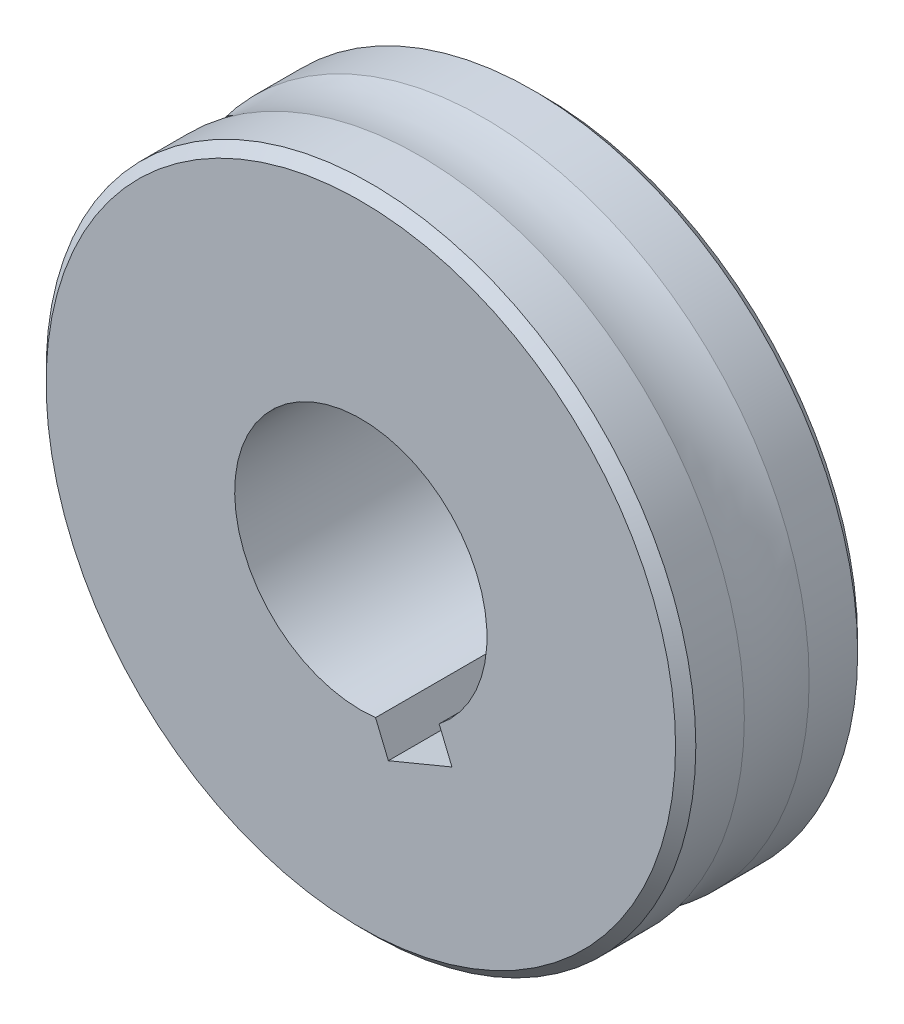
ISO-10303-21;
HEADER;
FILE_DESCRIPTION(('STEP AP214'),'2;1');
FILE_NAME('part.step','',(''),(''),'','','');
FILE_SCHEMA(('AUTOMOTIVE_DESIGN { 1 0 10303 214 1 1 1 1 }'));
ENDSEC;
DATA;
#1=APPLICATION_CONTEXT('core data for automotive mechanical design processes');
#2=APPLICATION_PROTOCOL_DEFINITION('international standard','automotive_design',2000,#1);
#3=PRODUCT_CONTEXT('',#1,'mechanical');
#4=PRODUCT('Part','Part','',(#3));
#5=PRODUCT_RELATED_PRODUCT_CATEGORY('part','',(#4));
#6=PRODUCT_DEFINITION_FORMATION('','',#4);
#7=PRODUCT_DEFINITION_CONTEXT('part definition',#1,'design');
#8=PRODUCT_DEFINITION('design','',#6,#7);
#9=PRODUCT_DEFINITION_SHAPE('','',#8);
#10=(LENGTH_UNIT() NAMED_UNIT(*) SI_UNIT(.MILLI.,.METRE.));
#11=(NAMED_UNIT(*) PLANE_ANGLE_UNIT() SI_UNIT($,.RADIAN.));
#12=(NAMED_UNIT(*) SI_UNIT($,.STERADIAN.) SOLID_ANGLE_UNIT());
#13=UNCERTAINTY_MEASURE_WITH_UNIT(LENGTH_MEASURE(1.E-05),#10,'distance_accuracy_value','');
#14=(GEOMETRIC_REPRESENTATION_CONTEXT(3) GLOBAL_UNCERTAINTY_ASSIGNED_CONTEXT((#13)) GLOBAL_UNIT_ASSIGNED_CONTEXT((#10,
#11,#12)) REPRESENTATION_CONTEXT('',''));
#15=CARTESIAN_POINT('',(0.,0.,0.));
#16=DIRECTION('',(0.,0.,1.));
#17=DIRECTION('',(1.,0.,0.));
#18=AXIS2_PLACEMENT_3D('',#15,#16,#17);
#19=CARTESIAN_POINT('',(0.,0.,7.9375));
#20=DIRECTION('',(0.,0.,-1.));
#21=DIRECTION('',(-1.,0.,0.));
#22=AXIS2_PLACEMENT_3D('',#19,#20,#21);
#23=PLANE('',#22);
#24=DIRECTION('',(0.383049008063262,-0.923728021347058,0.));
#25=VECTOR('',#24,1.);
#26=CARTESIAN_POINT('',(1.28262559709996,-10.9249655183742,7.9375));
#27=LINE('',#26,#25);
#28=CARTESIAN_POINT('',(1.28262559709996,-10.9249655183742,7.9375));
#29=VERTEX_POINT('',#28);
#30=CARTESIAN_POINT('',(2.39997754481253,-13.6194753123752,7.9375));
#31=VERTEX_POINT('',#30);
#32=EDGE_CURVE('E100',#29,#31,#27,.T.);
#33=ORIENTED_EDGE('',*,*,#32,.F.);
#34=CARTESIAN_POINT('',(0.,0.,7.9375));
#35=DIRECTION('',(0.,0.,1.));
#36=DIRECTION('',(1.,0.,0.));
#37=AXIS2_PLACEMENT_3D('',#34,#35,#36);
#38=CIRCLE('',#37,11.);
#39=CARTESIAN_POINT('',(6.82499372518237,-8.62667146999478,7.9375));
#40=VERTEX_POINT('',#39);
#41=EDGE_CURVE('E47',#40,#29,#38,.T.);
#42=ORIENTED_EDGE('',*,*,#41,.F.);
#43=DIRECTION('',(-0.383049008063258,0.92372802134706,0.));
#44=VECTOR('',#43,1.);
#45=CARTESIAN_POINT('',(7.94234567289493,-11.3211812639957,7.9375));
#46=LINE('',#45,#44);
#47=CARTESIAN_POINT('',(7.94234567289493,-11.3211812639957,7.9375));
#48=VERTEX_POINT('',#47);
#49=EDGE_CURVE('E91',#48,#40,#46,.T.);
#50=ORIENTED_EDGE('',*,*,#49,.F.);
#51=DIRECTION('',(0.923728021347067,0.38304900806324,0.));
#52=VECTOR('',#51,1.);
#53=CARTESIAN_POINT('',(2.39997754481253,-13.6194753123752,7.9375));
#54=LINE('',#53,#52);
#55=EDGE_CURVE('E94',#31,#48,#54,.T.);
#56=ORIENTED_EDGE('',*,*,#55,.F.);
#57=EDGE_LOOP('',(#33,#42,#50,#56));
#58=FACE_BOUND('',#57,.T.);
#59=CARTESIAN_POINT('',(0.,0.,7.9375));
#60=DIRECTION('',(0.,0.,1.));
#61=DIRECTION('',(1.,0.,0.));
#62=AXIS2_PLACEMENT_3D('',#59,#60,#61);
#63=CIRCLE('',#62,27.4402971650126);
#64=CARTESIAN_POINT('',(27.4402971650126,0.,7.9375));
#65=VERTEX_POINT('',#64);
#66=EDGE_CURVE('E106',#65,#65,#63,.T.);
#67=ORIENTED_EDGE('',*,*,#66,.T.);
#68=EDGE_LOOP('',(#67));
#69=FACE_BOUND('',#68,.T.);
#70=ADVANCED_FACE('F33',(#58,#69),#23,.F.);
#71=CARTESIAN_POINT('',(0.,0.,-7.9375));
#72=DIRECTION('',(0.,0.,1.));
#73=DIRECTION('',(1.,0.,0.));
#74=AXIS2_PLACEMENT_3D('',#71,#72,#73);
#75=PLANE('',#74);
#76=DIRECTION('',(-0.383049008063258,0.92372802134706,0.));
#77=VECTOR('',#76,1.);
#78=CARTESIAN_POINT('',(7.94234567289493,-11.3211812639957,-7.9375));
#79=LINE('',#78,#77);
#80=CARTESIAN_POINT('',(7.94234567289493,-11.3211812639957,-7.9375));
#81=VERTEX_POINT('',#80);
#82=CARTESIAN_POINT('',(6.82499372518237,-8.62667146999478,-7.9375));
#83=VERTEX_POINT('',#82);
#84=EDGE_CURVE('E81',#81,#83,#79,.T.);
#85=ORIENTED_EDGE('',*,*,#84,.T.);
#86=CARTESIAN_POINT('',(0.,0.,-7.9375));
#87=DIRECTION('',(0.,0.,1.));
#88=DIRECTION('',(1.,0.,0.));
#89=AXIS2_PLACEMENT_3D('',#86,#87,#88);
#90=CIRCLE('',#89,11.);
#91=CARTESIAN_POINT('',(1.28262559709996,-10.9249655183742,-7.9375));
#92=VERTEX_POINT('',#91);
#93=EDGE_CURVE('E75',#83,#92,#90,.T.);
#94=ORIENTED_EDGE('',*,*,#93,.T.);
#95=DIRECTION('',(0.383049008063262,-0.923728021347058,0.));
#96=VECTOR('',#95,1.);
#97=CARTESIAN_POINT('',(1.28262559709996,-10.9249655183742,-7.9375));
#98=LINE('',#97,#96);
#99=CARTESIAN_POINT('',(2.39997754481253,-13.6194753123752,-7.9375));
#100=VERTEX_POINT('',#99);
#101=EDGE_CURVE('E84',#92,#100,#98,.T.);
#102=ORIENTED_EDGE('',*,*,#101,.T.);
#103=DIRECTION('',(0.923728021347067,0.38304900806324,0.));
#104=VECTOR('',#103,1.);
#105=CARTESIAN_POINT('',(2.39997754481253,-13.6194753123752,-7.9375));
#106=LINE('',#105,#104);
#107=EDGE_CURVE('E55',#100,#81,#106,.T.);
#108=ORIENTED_EDGE('',*,*,#107,.T.);
#109=EDGE_LOOP('',(#85,#94,#102,#108));
#110=FACE_BOUND('',#109,.T.);
#111=CARTESIAN_POINT('',(0.,0.,-7.9375));
#112=DIRECTION('',(0.,0.,1.));
#113=DIRECTION('',(1.,0.,0.));
#114=AXIS2_PLACEMENT_3D('',#111,#112,#113);
#115=CIRCLE('',#114,27.4402971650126);
#116=CARTESIAN_POINT('',(27.4402971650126,0.,-7.9375));
#117=VERTEX_POINT('',#116);
#118=EDGE_CURVE('E11',#117,#117,#115,.T.);
#119=ORIENTED_EDGE('',*,*,#118,.F.);
#120=EDGE_LOOP('',(#119));
#121=FACE_BOUND('',#120,.T.);
#122=ADVANCED_FACE('F88',(#110,#121),#75,.F.);
#123=CARTESIAN_POINT('',(0.,0.,-7.9375));
#124=DIRECTION('',(0.,0.,1.));
#125=DIRECTION('',(1.,0.,0.));
#126=AXIS2_PLACEMENT_3D('',#123,#124,#125);
#127=CONICAL_SURFACE('',#126,27.4402971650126,0.78539816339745);
#128=CARTESIAN_POINT('',(0.,0.,-7.05485));
#129=DIRECTION('',(0.,0.,1.));
#130=DIRECTION('',(1.,0.,0.));
#131=AXIS2_PLACEMENT_3D('',#128,#129,#130);
#132=CIRCLE('',#131,28.3229471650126);
#133=CARTESIAN_POINT('',(28.3229471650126,0.,-7.05485));
#134=VERTEX_POINT('',#133);
#135=EDGE_CURVE('E40',#134,#134,#132,.T.);
#136=ORIENTED_EDGE('',*,*,#135,.F.);
#137=EDGE_LOOP('',(#136));
#138=FACE_BOUND('',#137,.T.);
#139=ORIENTED_EDGE('',*,*,#118,.T.);
#140=EDGE_LOOP('',(#139));
#141=FACE_BOUND('',#140,.T.);
#142=ADVANCED_FACE('F125',(#138,#141),#127,.T.);
#143=CARTESIAN_POINT('',(0.,0.,15.875));
#144=DIRECTION('',(0.,0.,1.));
#145=DIRECTION('',(1.,0.,0.));
#146=AXIS2_PLACEMENT_3D('',#143,#144,#145);
#147=CYLINDRICAL_SURFACE('',#146,28.3229471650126);
#148=CARTESIAN_POINT('',(0.,0.,-2.82485099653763));
#149=DIRECTION('',(0.,0.,1.));
#150=DIRECTION('',(1.,0.,0.));
#151=AXIS2_PLACEMENT_3D('',#148,#149,#150);
#152=CIRCLE('',#151,28.3229471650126);
#153=CARTESIAN_POINT('',(28.3229471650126,0.,-2.82485099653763));
#154=VERTEX_POINT('',#153);
#155=EDGE_CURVE('E118',#154,#154,#152,.T.);
#156=ORIENTED_EDGE('',*,*,#155,.F.);
#157=EDGE_LOOP('',(#156));
#158=FACE_BOUND('',#157,.T.);
#159=ORIENTED_EDGE('',*,*,#135,.T.);
#160=EDGE_LOOP('',(#159));
#161=FACE_BOUND('',#160,.T.);
#162=ADVANCED_FACE('F123',(#158,#161),#147,.T.);
#163=CARTESIAN_POINT('',(0.,0.,0.));
#164=DIRECTION('',(0.,0.,1.));
#165=DIRECTION('',(1.,0.,0.));
#166=AXIS2_PLACEMENT_3D('',#163,#164,#165);
#167=TOROIDAL_SURFACE('',#166,40.5161,12.5161);
#168=CARTESIAN_POINT('',(0.,0.,2.82485099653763));
#169=DIRECTION('',(0.,0.,1.));
#170=DIRECTION('',(1.,0.,0.));
#171=AXIS2_PLACEMENT_3D('',#168,#169,#170);
#172=CIRCLE('',#171,28.3229471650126);
#173=CARTESIAN_POINT('',(28.3229471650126,0.,2.82485099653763));
#174=VERTEX_POINT('',#173);
#175=EDGE_CURVE('E115',#174,#174,#172,.T.);
#176=ORIENTED_EDGE('',*,*,#175,.F.);
#177=EDGE_LOOP('',(#176));
#178=FACE_BOUND('',#177,.T.);
#179=ORIENTED_EDGE('',*,*,#155,.T.);
#180=EDGE_LOOP('',(#179));
#181=FACE_BOUND('',#180,.T.);
#182=ADVANCED_FACE('F138',(#178,#181),#167,.F.);
#183=CARTESIAN_POINT('',(0.,0.,15.875));
#184=DIRECTION('',(0.,0.,1.));
#185=DIRECTION('',(1.,0.,0.));
#186=AXIS2_PLACEMENT_3D('',#183,#184,#185);
#187=CYLINDRICAL_SURFACE('',#186,28.3229471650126);
#188=CARTESIAN_POINT('',(0.,0.,7.05485));
#189=DIRECTION('',(0.,0.,1.));
#190=DIRECTION('',(1.,0.,0.));
#191=AXIS2_PLACEMENT_3D('',#188,#189,#190);
#192=CIRCLE('',#191,28.3229471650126);
#193=CARTESIAN_POINT('',(28.3229471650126,0.,7.05485));
#194=VERTEX_POINT('',#193);
#195=EDGE_CURVE('E112',#194,#194,#192,.T.);
#196=ORIENTED_EDGE('',*,*,#195,.F.);
#197=EDGE_LOOP('',(#196));
#198=FACE_BOUND('',#197,.T.);
#199=ORIENTED_EDGE('',*,*,#175,.T.);
#200=EDGE_LOOP('',(#199));
#201=FACE_BOUND('',#200,.T.);
#202=ADVANCED_FACE('F142',(#198,#201),#187,.T.);
#203=CARTESIAN_POINT('',(0.,0.,7.05485));
#204=DIRECTION('',(0.,0.,-1.));
#205=DIRECTION('',(-1.,0.,0.));
#206=AXIS2_PLACEMENT_3D('',#203,#204,#205);
#207=CONICAL_SURFACE('',#206,28.3229471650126,0.785398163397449);
#208=ORIENTED_EDGE('',*,*,#66,.F.);
#209=EDGE_LOOP('',(#208));
#210=FACE_BOUND('',#209,.T.);
#211=ORIENTED_EDGE('',*,*,#195,.T.);
#212=EDGE_LOOP('',(#211));
#213=FACE_BOUND('',#212,.T.);
#214=ADVANCED_FACE('F146',(#210,#213),#207,.T.);
#215=CARTESIAN_POINT('',(0.,0.,-7.9375));
#216=DIRECTION('',(0.,0.,1.));
#217=DIRECTION('',(1.,0.,0.));
#218=AXIS2_PLACEMENT_3D('',#215,#216,#217);
#219=CYLINDRICAL_SURFACE('',#218,11.);
#220=ORIENTED_EDGE('',*,*,#41,.T.);
#221=DIRECTION('',(0.,0.,1.));
#222=VECTOR('',#221,1.);
#223=CARTESIAN_POINT('',(1.28262559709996,-10.9249655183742,-7.9375));
#224=LINE('',#223,#222);
#225=EDGE_CURVE('E71',#92,#29,#224,.T.);
#226=ORIENTED_EDGE('',*,*,#225,.F.);
#227=ORIENTED_EDGE('',*,*,#93,.F.);
#228=DIRECTION('',(0.,0.,1.));
#229=VECTOR('',#228,1.);
#230=CARTESIAN_POINT('',(6.82499372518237,-8.62667146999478,-7.9375));
#231=LINE('',#230,#229);
#232=EDGE_CURVE('E104',#83,#40,#231,.T.);
#233=ORIENTED_EDGE('',*,*,#232,.T.);
#234=EDGE_LOOP('',(#220,#226,#227,#233));
#235=FACE_BOUND('',#234,.T.);
#236=ADVANCED_FACE('F73',(#235),#219,.F.);
#237=CARTESIAN_POINT('',(7.94234567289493,-11.3211812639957,-7.9375));
#238=DIRECTION('',(0.92372802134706,0.383049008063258,0.));
#239=DIRECTION('',(-0.383049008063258,0.92372802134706,0.));
#240=AXIS2_PLACEMENT_3D('',#237,#238,#239);
#241=PLANE('',#240);
#242=ORIENTED_EDGE('',*,*,#49,.T.);
#243=ORIENTED_EDGE('',*,*,#232,.F.);
#244=ORIENTED_EDGE('',*,*,#84,.F.);
#245=DIRECTION('',(0.,0.,1.));
#246=VECTOR('',#245,1.);
#247=CARTESIAN_POINT('',(7.94234567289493,-11.3211812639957,-7.9375));
#248=LINE('',#247,#246);
#249=EDGE_CURVE('E107',#81,#48,#248,.T.);
#250=ORIENTED_EDGE('',*,*,#249,.T.);
#251=EDGE_LOOP('',(#242,#243,#244,#250));
#252=FACE_BOUND('',#251,.T.);
#253=ADVANCED_FACE('F153',(#252),#241,.F.);
#254=CARTESIAN_POINT('',(2.39997754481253,-13.6194753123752,-7.9375));
#255=DIRECTION('',(0.383049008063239,-0.923728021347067,0.));
#256=DIRECTION('',(0.923728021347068,0.38304900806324,0.));
#257=AXIS2_PLACEMENT_3D('',#254,#255,#256);
#258=PLANE('',#257);
#259=ORIENTED_EDGE('',*,*,#55,.T.);
#260=ORIENTED_EDGE('',*,*,#249,.F.);
#261=ORIENTED_EDGE('',*,*,#107,.F.);
#262=DIRECTION('',(0.,0.,1.));
#263=VECTOR('',#262,1.);
#264=CARTESIAN_POINT('',(2.39997754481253,-13.6194753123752,-7.9375));
#265=LINE('',#264,#263);
#266=EDGE_CURVE('E80',#100,#31,#265,.T.);
#267=ORIENTED_EDGE('',*,*,#266,.T.);
#268=EDGE_LOOP('',(#259,#260,#261,#267));
#269=FACE_BOUND('',#268,.T.);
#270=ADVANCED_FACE('F156',(#269),#258,.F.);
#271=CARTESIAN_POINT('',(1.28262559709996,-10.9249655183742,-7.9375));
#272=DIRECTION('',(-0.923728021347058,-0.383049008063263,0.));
#273=DIRECTION('',(0.383049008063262,-0.923728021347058,0.));
#274=AXIS2_PLACEMENT_3D('',#271,#272,#273);
#275=PLANE('',#274);
#276=ORIENTED_EDGE('',*,*,#32,.T.);
#277=ORIENTED_EDGE('',*,*,#266,.F.);
#278=ORIENTED_EDGE('',*,*,#101,.F.);
#279=ORIENTED_EDGE('',*,*,#225,.T.);
#280=EDGE_LOOP('',(#276,#277,#278,#279));
#281=FACE_BOUND('',#280,.T.);
#282=ADVANCED_FACE('F85',(#281),#275,.F.);
#283=CLOSED_SHELL('',(#70,#122,#142,#162,#182,#202,#214,#236,#253,#270,#282));
#284=MANIFOLD_SOLID_BREP('B2',#283);
#285=ADVANCED_BREP_SHAPE_REPRESENTATION('',(#18,#284),#14);
#286=SHAPE_DEFINITION_REPRESENTATION(#9,#285);
ENDSEC;
END-ISO-10303-21;
